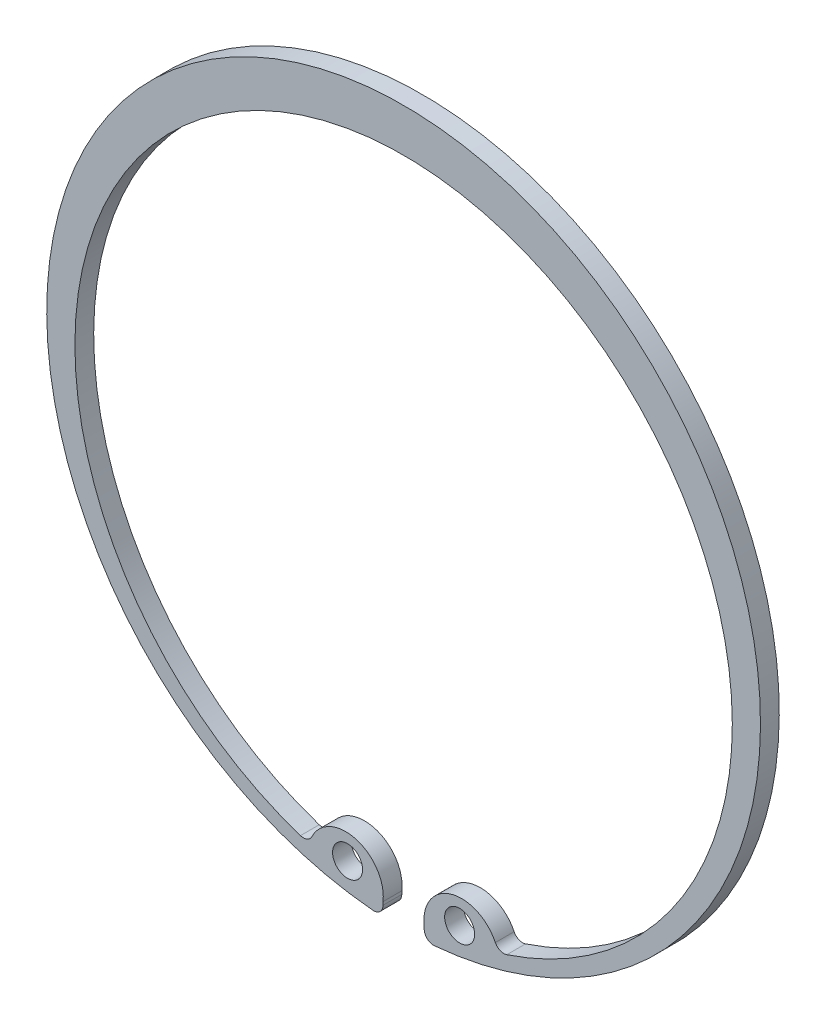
ISO-10303-21;
HEADER;
FILE_DESCRIPTION(('STEP AP214'),'2;1');
FILE_NAME('part.step','',(''),(''),'','','');
FILE_SCHEMA(('AUTOMOTIVE_DESIGN { 1 0 10303 214 1 1 1 1 }'));
ENDSEC;
DATA;
#1=APPLICATION_CONTEXT('core data for automotive mechanical design processes');
#2=APPLICATION_PROTOCOL_DEFINITION('international standard','automotive_design',2000,#1);
#3=PRODUCT_CONTEXT('',#1,'mechanical');
#4=PRODUCT('Part','Part','',(#3));
#5=PRODUCT_RELATED_PRODUCT_CATEGORY('part','',(#4));
#6=PRODUCT_DEFINITION_FORMATION('','',#4);
#7=PRODUCT_DEFINITION_CONTEXT('part definition',#1,'design');
#8=PRODUCT_DEFINITION('design','',#6,#7);
#9=PRODUCT_DEFINITION_SHAPE('','',#8);
#10=(LENGTH_UNIT() NAMED_UNIT(*) SI_UNIT(.MILLI.,.METRE.));
#11=(NAMED_UNIT(*) PLANE_ANGLE_UNIT() SI_UNIT($,.RADIAN.));
#12=(NAMED_UNIT(*) SI_UNIT($,.STERADIAN.) SOLID_ANGLE_UNIT());
#13=UNCERTAINTY_MEASURE_WITH_UNIT(LENGTH_MEASURE(1.E-05),#10,'distance_accuracy_value','');
#14=(GEOMETRIC_REPRESENTATION_CONTEXT(3) GLOBAL_UNCERTAINTY_ASSIGNED_CONTEXT((#13)) GLOBAL_UNIT_ASSIGNED_CONTEXT((#10,
#11,#12)) REPRESENTATION_CONTEXT('',''));
#15=CARTESIAN_POINT('',(0.,0.,0.));
#16=DIRECTION('',(0.,0.,1.));
#17=DIRECTION('',(1.,0.,0.));
#18=AXIS2_PLACEMENT_3D('',#15,#16,#17);
#19=CARTESIAN_POINT('',(0.,0.,1.));
#20=DIRECTION('',(0.,0.,1.));
#21=DIRECTION('',(1.,0.,0.));
#22=AXIS2_PLACEMENT_3D('',#19,#20,#21);
#23=PLANE('',#22);
#24=CARTESIAN_POINT('',(0.,0.,1.));
#25=DIRECTION('',(0.,0.,1.));
#26=DIRECTION('',(1.,0.,0.));
#27=AXIS2_PLACEMENT_3D('',#24,#25,#26);
#28=CIRCLE('',#27,19.);
#29=CARTESIAN_POINT('',(1.64011368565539,-18.9290788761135,1.));
#30=VERTEX_POINT('',#29);
#31=CARTESIAN_POINT('',(-1.64011368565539,-18.9290788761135,1.));
#32=VERTEX_POINT('',#31);
#33=EDGE_CURVE('E141',#30,#32,#28,.T.);
#34=ORIENTED_EDGE('',*,*,#33,.T.);
#35=CARTESIAN_POINT('',(-1.59695279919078,-18.4309452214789,1.));
#36=DIRECTION('',(0.,0.,1.));
#37=DIRECTION('',(1.,0.,0.));
#38=AXIS2_PLACEMENT_3D('',#35,#36,#37);
#39=CIRCLE('',#38,0.5);
#40=CARTESIAN_POINT('',(-1.09695279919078,-18.4309452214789,1.));
#41=VERTEX_POINT('',#40);
#42=EDGE_CURVE('E167',#32,#41,#39,.T.);
#43=ORIENTED_EDGE('',*,*,#42,.T.);
#44=DIRECTION('',(0.,1.,0.));
#45=VECTOR('',#44,1.);
#46=CARTESIAN_POINT('',(-1.09695279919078,-18.9683076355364,1.));
#47=LINE('',#46,#45);
#48=CARTESIAN_POINT('',(-1.09695279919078,-18.2655860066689,1.));
#49=VERTEX_POINT('',#48);
#50=EDGE_CURVE('E144',#41,#49,#47,.T.);
#51=ORIENTED_EDGE('',*,*,#50,.T.);
#52=CARTESIAN_POINT('',(-3.08259444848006,-18.0263638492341,1.));
#53=DIRECTION('',(0.,0.,1.));
#54=DIRECTION('',(1.,0.,0.));
#55=AXIS2_PLACEMENT_3D('',#52,#53,#54);
#56=CIRCLE('',#55,2.);
#57=CARTESIAN_POINT('',(-4.88437347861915,-17.1582668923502,1.));
#58=VERTEX_POINT('',#57);
#59=EDGE_CURVE('E125',#49,#58,#56,.T.);
#60=ORIENTED_EDGE('',*,*,#59,.T.);
#61=CARTESIAN_POINT('',(-5.33481823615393,-16.9412426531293,1.));
#62=DIRECTION('',(0.,0.,1.));
#63=DIRECTION('',(1.,0.,0.));
#64=AXIS2_PLACEMENT_3D('',#61,#62,#63);
#65=CIRCLE('',#64,0.5);
#66=CARTESIAN_POINT('',(-5.49172465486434,-17.4159850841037,1.));
#67=VERTEX_POINT('',#66);
#68=EDGE_CURVE('E11',#58,#67,#65,.F.);
#69=ORIENTED_EDGE('',*,*,#68,.T.);
#70=CARTESIAN_POINT('',(0.,-0.8,1.));
#71=DIRECTION('',(0.,0.,-1.));
#72=DIRECTION('',(1.,0.,0.));
#73=AXIS2_PLACEMENT_3D('',#70,#71,#72);
#74=CIRCLE('',#73,17.5);
#75=CARTESIAN_POINT('',(5.49172465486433,-17.4159850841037,1.));
#76=VERTEX_POINT('',#75);
#77=EDGE_CURVE('E147',#67,#76,#74,.T.);
#78=ORIENTED_EDGE('',*,*,#77,.T.);
#79=CARTESIAN_POINT('',(5.33481823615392,-16.9412426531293,1.));
#80=DIRECTION('',(0.,0.,1.));
#81=DIRECTION('',(1.,0.,0.));
#82=AXIS2_PLACEMENT_3D('',#79,#80,#81);
#83=CIRCLE('',#82,0.5);
#84=CARTESIAN_POINT('',(4.88437347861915,-17.1582668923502,1.));
#85=VERTEX_POINT('',#84);
#86=EDGE_CURVE('E50',#76,#85,#83,.F.);
#87=ORIENTED_EDGE('',*,*,#86,.T.);
#88=CARTESIAN_POINT('',(3.08259444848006,-18.0263638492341,1.));
#89=DIRECTION('',(0.,0.,1.));
#90=DIRECTION('',(-1.,0.,0.));
#91=AXIS2_PLACEMENT_3D('',#88,#89,#90);
#92=CIRCLE('',#91,2.);
#93=CARTESIAN_POINT('',(1.09695279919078,-18.2655860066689,1.));
#94=VERTEX_POINT('',#93);
#95=EDGE_CURVE('E149',#85,#94,#92,.T.);
#96=ORIENTED_EDGE('',*,*,#95,.T.);
#97=DIRECTION('',(0.,-1.,0.));
#98=VECTOR('',#97,1.);
#99=CARTESIAN_POINT('',(1.09695279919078,-18.9683076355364,1.));
#100=LINE('',#99,#98);
#101=CARTESIAN_POINT('',(1.09695279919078,-18.4309452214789,1.));
#102=VERTEX_POINT('',#101);
#103=EDGE_CURVE('E151',#94,#102,#100,.T.);
#104=ORIENTED_EDGE('',*,*,#103,.T.);
#105=CARTESIAN_POINT('',(1.59695279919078,-18.4309452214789,1.));
#106=DIRECTION('',(0.,0.,1.));
#107=DIRECTION('',(1.,0.,0.));
#108=AXIS2_PLACEMENT_3D('',#105,#106,#107);
#109=CIRCLE('',#108,0.5);
#110=EDGE_CURVE('E165',#102,#30,#109,.T.);
#111=ORIENTED_EDGE('',*,*,#110,.T.);
#112=EDGE_LOOP('',(#34,#43,#51,#60,#69,#78,#87,#96,#104,#111));
#113=FACE_BOUND('',#112,.T.);
#114=CARTESIAN_POINT('',(-2.98328309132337,-17.3321267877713,1.));
#115=DIRECTION('',(0.,0.,1.));
#116=DIRECTION('',(1.,0.,0.));
#117=AXIS2_PLACEMENT_3D('',#114,#115,#116);
#118=CIRCLE('',#117,0.798800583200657);
#119=CARTESIAN_POINT('',(-2.18448250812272,-17.3321267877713,1.));
#120=VERTEX_POINT('',#119);
#121=EDGE_CURVE('E207',#120,#120,#118,.T.);
#122=ORIENTED_EDGE('',*,*,#121,.F.);
#123=EDGE_LOOP('',(#122));
#124=FACE_BOUND('',#123,.T.);
#125=CARTESIAN_POINT('',(2.98328309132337,-17.3321267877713,1.));
#126=DIRECTION('',(0.,0.,-1.));
#127=DIRECTION('',(-1.,0.,0.));
#128=AXIS2_PLACEMENT_3D('',#125,#126,#127);
#129=CIRCLE('',#128,0.798800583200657);
#130=CARTESIAN_POINT('',(2.18448250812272,-17.3321267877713,1.));
#131=VERTEX_POINT('',#130);
#132=EDGE_CURVE('E215',#131,#131,#129,.T.);
#133=ORIENTED_EDGE('',*,*,#132,.T.);
#134=EDGE_LOOP('',(#133));
#135=FACE_BOUND('',#134,.T.);
#136=ADVANCED_FACE('F27',(#113,#124,#135),#23,.T.);
#137=CARTESIAN_POINT('',(0.,0.,0.));
#138=DIRECTION('',(0.,0.,1.));
#139=DIRECTION('',(1.,0.,0.));
#140=AXIS2_PLACEMENT_3D('',#137,#138,#139);
#141=PLANE('',#140);
#142=DIRECTION('',(0.,1.,0.));
#143=VECTOR('',#142,1.);
#144=CARTESIAN_POINT('',(-1.09695279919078,-18.9683076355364,0.));
#145=LINE('',#144,#143);
#146=CARTESIAN_POINT('',(-1.09695279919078,-18.4309452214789,0.));
#147=VERTEX_POINT('',#146);
#148=CARTESIAN_POINT('',(-1.09695279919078,-18.2655860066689,0.));
#149=VERTEX_POINT('',#148);
#150=EDGE_CURVE('E107',#147,#149,#145,.T.);
#151=ORIENTED_EDGE('',*,*,#150,.F.);
#152=CARTESIAN_POINT('',(-1.59695279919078,-18.4309452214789,0.));
#153=DIRECTION('',(0.,0.,1.));
#154=DIRECTION('',(1.,0.,0.));
#155=AXIS2_PLACEMENT_3D('',#152,#153,#154);
#156=CIRCLE('',#155,0.5);
#157=CARTESIAN_POINT('',(-1.64011368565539,-18.9290788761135,0.));
#158=VERTEX_POINT('',#157);
#159=EDGE_CURVE('E158',#147,#158,#156,.F.);
#160=ORIENTED_EDGE('',*,*,#159,.T.);
#161=CARTESIAN_POINT('',(0.,0.,0.));
#162=DIRECTION('',(0.,0.,1.));
#163=DIRECTION('',(1.,0.,0.));
#164=AXIS2_PLACEMENT_3D('',#161,#162,#163);
#165=CIRCLE('',#164,19.);
#166=CARTESIAN_POINT('',(1.64011368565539,-18.9290788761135,0.));
#167=VERTEX_POINT('',#166);
#168=EDGE_CURVE('E118',#167,#158,#165,.T.);
#169=ORIENTED_EDGE('',*,*,#168,.F.);
#170=CARTESIAN_POINT('',(1.59695279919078,-18.4309452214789,0.));
#171=DIRECTION('',(0.,0.,1.));
#172=DIRECTION('',(1.,0.,0.));
#173=AXIS2_PLACEMENT_3D('',#170,#171,#172);
#174=CIRCLE('',#173,0.5);
#175=CARTESIAN_POINT('',(1.09695279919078,-18.4309452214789,0.));
#176=VERTEX_POINT('',#175);
#177=EDGE_CURVE('E156',#167,#176,#174,.F.);
#178=ORIENTED_EDGE('',*,*,#177,.T.);
#179=DIRECTION('',(0.,-1.,0.));
#180=VECTOR('',#179,1.);
#181=CARTESIAN_POINT('',(1.09695279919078,-18.9683076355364,0.));
#182=LINE('',#181,#180);
#183=CARTESIAN_POINT('',(1.09695279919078,-18.2655860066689,0.));
#184=VERTEX_POINT('',#183);
#185=EDGE_CURVE('E139',#184,#176,#182,.T.);
#186=ORIENTED_EDGE('',*,*,#185,.F.);
#187=CARTESIAN_POINT('',(3.08259444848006,-18.0263638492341,0.));
#188=DIRECTION('',(0.,0.,1.));
#189=DIRECTION('',(-1.,0.,0.));
#190=AXIS2_PLACEMENT_3D('',#187,#188,#189);
#191=CIRCLE('',#190,2.);
#192=CARTESIAN_POINT('',(4.88437347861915,-17.1582668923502,0.));
#193=VERTEX_POINT('',#192);
#194=EDGE_CURVE('E134',#193,#184,#191,.T.);
#195=ORIENTED_EDGE('',*,*,#194,.F.);
#196=CARTESIAN_POINT('',(5.33481823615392,-16.9412426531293,0.));
#197=DIRECTION('',(0.,0.,1.));
#198=DIRECTION('',(1.,0.,0.));
#199=AXIS2_PLACEMENT_3D('',#196,#197,#198);
#200=CIRCLE('',#199,0.5);
#201=CARTESIAN_POINT('',(5.49172465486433,-17.4159850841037,0.));
#202=VERTEX_POINT('',#201);
#203=EDGE_CURVE('E180',#193,#202,#200,.T.);
#204=ORIENTED_EDGE('',*,*,#203,.T.);
#205=CARTESIAN_POINT('',(0.,-0.8,0.));
#206=DIRECTION('',(0.,0.,-1.));
#207=DIRECTION('',(1.,0.,0.));
#208=AXIS2_PLACEMENT_3D('',#205,#206,#207);
#209=CIRCLE('',#208,17.5);
#210=CARTESIAN_POINT('',(-5.49172465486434,-17.4159850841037,0.));
#211=VERTEX_POINT('',#210);
#212=EDGE_CURVE('E131',#211,#202,#209,.T.);
#213=ORIENTED_EDGE('',*,*,#212,.F.);
#214=CARTESIAN_POINT('',(-5.33481823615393,-16.9412426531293,0.));
#215=DIRECTION('',(0.,0.,1.));
#216=DIRECTION('',(1.,0.,0.));
#217=AXIS2_PLACEMENT_3D('',#214,#215,#216);
#218=CIRCLE('',#217,0.5);
#219=CARTESIAN_POINT('',(-4.88437347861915,-17.1582668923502,0.));
#220=VERTEX_POINT('',#219);
#221=EDGE_CURVE('E35',#211,#220,#218,.T.);
#222=ORIENTED_EDGE('',*,*,#221,.T.);
#223=CARTESIAN_POINT('',(-3.08259444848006,-18.0263638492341,0.));
#224=DIRECTION('',(0.,0.,1.));
#225=DIRECTION('',(1.,0.,0.));
#226=AXIS2_PLACEMENT_3D('',#223,#224,#225);
#227=CIRCLE('',#226,2.);
#228=EDGE_CURVE('E117',#149,#220,#227,.T.);
#229=ORIENTED_EDGE('',*,*,#228,.F.);
#230=EDGE_LOOP('',(#151,#160,#169,#178,#186,#195,#204,#213,#222,#229));
#231=FACE_BOUND('',#230,.T.);
#232=CARTESIAN_POINT('',(-2.98328309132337,-17.3321267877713,0.));
#233=DIRECTION('',(0.,0.,1.));
#234=DIRECTION('',(1.,0.,0.));
#235=AXIS2_PLACEMENT_3D('',#232,#233,#234);
#236=CIRCLE('',#235,0.798800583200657);
#237=CARTESIAN_POINT('',(-2.18448250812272,-17.3321267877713,0.));
#238=VERTEX_POINT('',#237);
#239=EDGE_CURVE('E205',#238,#238,#236,.T.);
#240=ORIENTED_EDGE('',*,*,#239,.T.);
#241=EDGE_LOOP('',(#240));
#242=FACE_BOUND('',#241,.T.);
#243=CARTESIAN_POINT('',(2.98328309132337,-17.3321267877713,0.));
#244=DIRECTION('',(0.,0.,-1.));
#245=DIRECTION('',(-1.,0.,0.));
#246=AXIS2_PLACEMENT_3D('',#243,#244,#245);
#247=CIRCLE('',#246,0.798800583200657);
#248=CARTESIAN_POINT('',(2.18448250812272,-17.3321267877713,0.));
#249=VERTEX_POINT('',#248);
#250=EDGE_CURVE('E212',#249,#249,#247,.T.);
#251=ORIENTED_EDGE('',*,*,#250,.F.);
#252=EDGE_LOOP('',(#251));
#253=FACE_BOUND('',#252,.T.);
#254=ADVANCED_FACE('F128',(#231,#242,#253),#141,.F.);
#255=CARTESIAN_POINT('',(0.,0.,1.));
#256=DIRECTION('',(0.,0.,-1.));
#257=DIRECTION('',(-1.,0.,0.));
#258=AXIS2_PLACEMENT_3D('',#255,#256,#257);
#259=CYLINDRICAL_SURFACE('',#258,19.);
#260=ORIENTED_EDGE('',*,*,#168,.T.);
#261=DIRECTION('',(0.,0.,-1.));
#262=VECTOR('',#261,1.);
#263=CARTESIAN_POINT('',(-1.64011368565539,-18.9290788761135,1.));
#264=LINE('',#263,#262);
#265=EDGE_CURVE('E163',#158,#32,#264,.F.);
#266=ORIENTED_EDGE('',*,*,#265,.T.);
#267=ORIENTED_EDGE('',*,*,#33,.F.);
#268=DIRECTION('',(0.,0.,-1.));
#269=VECTOR('',#268,1.);
#270=CARTESIAN_POINT('',(1.64011368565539,-18.9290788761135,1.));
#271=LINE('',#270,#269);
#272=EDGE_CURVE('E160',#30,#167,#271,.T.);
#273=ORIENTED_EDGE('',*,*,#272,.T.);
#274=EDGE_LOOP('',(#260,#266,#267,#273));
#275=FACE_BOUND('',#274,.T.);
#276=ADVANCED_FACE('F29',(#275),#259,.T.);
#277=CARTESIAN_POINT('',(-1.09695279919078,-18.9683076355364,1.));
#278=DIRECTION('',(-1.,0.,0.));
#279=DIRECTION('',(0.,0.,1.));
#280=AXIS2_PLACEMENT_3D('',#277,#278,#279);
#281=PLANE('',#280);
#282=ORIENTED_EDGE('',*,*,#50,.F.);
#283=DIRECTION('',(0.,0.,-1.));
#284=VECTOR('',#283,1.);
#285=CARTESIAN_POINT('',(-1.09695279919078,-18.4309452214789,1.));
#286=LINE('',#285,#284);
#287=EDGE_CURVE('E114',#41,#147,#286,.T.);
#288=ORIENTED_EDGE('',*,*,#287,.T.);
#289=ORIENTED_EDGE('',*,*,#150,.T.);
#290=DIRECTION('',(0.,0.,-1.));
#291=VECTOR('',#290,1.);
#292=CARTESIAN_POINT('',(-1.09695279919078,-18.2655860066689,1.));
#293=LINE('',#292,#291);
#294=EDGE_CURVE('E111',#49,#149,#293,.T.);
#295=ORIENTED_EDGE('',*,*,#294,.F.);
#296=EDGE_LOOP('',(#282,#288,#289,#295));
#297=FACE_BOUND('',#296,.T.);
#298=ADVANCED_FACE('F110',(#297),#281,.F.);
#299=CARTESIAN_POINT('',(-3.08259444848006,-18.0263638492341,1.));
#300=DIRECTION('',(0.,0.,-1.));
#301=DIRECTION('',(-1.,0.,0.));
#302=AXIS2_PLACEMENT_3D('',#299,#300,#301);
#303=CYLINDRICAL_SURFACE('',#302,2.);
#304=ORIENTED_EDGE('',*,*,#228,.T.);
#305=DIRECTION('',(0.,0.,-1.));
#306=VECTOR('',#305,1.);
#307=CARTESIAN_POINT('',(-4.88437347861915,-17.1582668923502,1.));
#308=LINE('',#307,#306);
#309=EDGE_CURVE('E178',#220,#58,#308,.F.);
#310=ORIENTED_EDGE('',*,*,#309,.T.);
#311=ORIENTED_EDGE('',*,*,#59,.F.);
#312=ORIENTED_EDGE('',*,*,#294,.T.);
#313=EDGE_LOOP('',(#304,#310,#311,#312));
#314=FACE_BOUND('',#313,.T.);
#315=ADVANCED_FACE('F122',(#314),#303,.T.);
#316=CARTESIAN_POINT('',(0.,-0.8,1.));
#317=DIRECTION('',(0.,0.,-1.));
#318=DIRECTION('',(-1.,0.,0.));
#319=AXIS2_PLACEMENT_3D('',#316,#317,#318);
#320=CYLINDRICAL_SURFACE('',#319,17.5);
#321=ORIENTED_EDGE('',*,*,#212,.T.);
#322=DIRECTION('',(0.,0.,-1.));
#323=VECTOR('',#322,1.);
#324=CARTESIAN_POINT('',(5.49172465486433,-17.4159850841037,1.));
#325=LINE('',#324,#323);
#326=EDGE_CURVE('E176',#202,#76,#325,.F.);
#327=ORIENTED_EDGE('',*,*,#326,.T.);
#328=ORIENTED_EDGE('',*,*,#77,.F.);
#329=DIRECTION('',(0.,0.,-1.));
#330=VECTOR('',#329,1.);
#331=CARTESIAN_POINT('',(-5.49172465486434,-17.4159850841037,1.));
#332=LINE('',#331,#330);
#333=EDGE_CURVE('E173',#67,#211,#332,.T.);
#334=ORIENTED_EDGE('',*,*,#333,.T.);
#335=EDGE_LOOP('',(#321,#327,#328,#334));
#336=FACE_BOUND('',#335,.T.);
#337=ADVANCED_FACE('F188',(#336),#320,.F.);
#338=CARTESIAN_POINT('',(3.08259444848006,-18.0263638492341,1.));
#339=DIRECTION('',(0.,0.,-1.));
#340=DIRECTION('',(-1.,0.,0.));
#341=AXIS2_PLACEMENT_3D('',#338,#339,#340);
#342=CYLINDRICAL_SURFACE('',#341,2.);
#343=ORIENTED_EDGE('',*,*,#95,.F.);
#344=DIRECTION('',(0.,0.,-1.));
#345=VECTOR('',#344,1.);
#346=CARTESIAN_POINT('',(4.88437347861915,-17.1582668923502,1.));
#347=LINE('',#346,#345);
#348=EDGE_CURVE('E170',#85,#193,#347,.T.);
#349=ORIENTED_EDGE('',*,*,#348,.T.);
#350=ORIENTED_EDGE('',*,*,#194,.T.);
#351=DIRECTION('',(0.,0.,-1.));
#352=VECTOR('',#351,1.);
#353=CARTESIAN_POINT('',(1.09695279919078,-18.2655860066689,1.));
#354=LINE('',#353,#352);
#355=EDGE_CURVE('E126',#94,#184,#354,.T.);
#356=ORIENTED_EDGE('',*,*,#355,.F.);
#357=EDGE_LOOP('',(#343,#349,#350,#356));
#358=FACE_BOUND('',#357,.T.);
#359=ADVANCED_FACE('F193',(#358),#342,.T.);
#360=CARTESIAN_POINT('',(1.09695279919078,-18.9683076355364,1.));
#361=DIRECTION('',(1.,0.,0.));
#362=DIRECTION('',(0.,0.,-1.));
#363=AXIS2_PLACEMENT_3D('',#360,#361,#362);
#364=PLANE('',#363);
#365=ORIENTED_EDGE('',*,*,#185,.T.);
#366=DIRECTION('',(0.,0.,-1.));
#367=VECTOR('',#366,1.);
#368=CARTESIAN_POINT('',(1.09695279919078,-18.4309452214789,1.));
#369=LINE('',#368,#367);
#370=EDGE_CURVE('E42',#176,#102,#369,.F.);
#371=ORIENTED_EDGE('',*,*,#370,.T.);
#372=ORIENTED_EDGE('',*,*,#103,.F.);
#373=ORIENTED_EDGE('',*,*,#355,.T.);
#374=EDGE_LOOP('',(#365,#371,#372,#373));
#375=FACE_BOUND('',#374,.T.);
#376=ADVANCED_FACE('F239',(#375),#364,.F.);
#377=CARTESIAN_POINT('',(-1.59695279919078,-18.4309452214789,1.));
#378=DIRECTION('',(0.,0.,-1.));
#379=DIRECTION('',(-1.,0.,0.));
#380=AXIS2_PLACEMENT_3D('',#377,#378,#379);
#381=CYLINDRICAL_SURFACE('',#380,0.5);
#382=ORIENTED_EDGE('',*,*,#42,.F.);
#383=ORIENTED_EDGE('',*,*,#265,.F.);
#384=ORIENTED_EDGE('',*,*,#159,.F.);
#385=ORIENTED_EDGE('',*,*,#287,.F.);
#386=EDGE_LOOP('',(#382,#383,#384,#385));
#387=FACE_BOUND('',#386,.T.);
#388=ADVANCED_FACE('F242',(#387),#381,.T.);
#389=CARTESIAN_POINT('',(1.59695279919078,-18.4309452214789,1.));
#390=DIRECTION('',(0.,0.,-1.));
#391=DIRECTION('',(-1.,0.,0.));
#392=AXIS2_PLACEMENT_3D('',#389,#390,#391);
#393=CYLINDRICAL_SURFACE('',#392,0.5);
#394=ORIENTED_EDGE('',*,*,#110,.F.);
#395=ORIENTED_EDGE('',*,*,#370,.F.);
#396=ORIENTED_EDGE('',*,*,#177,.F.);
#397=ORIENTED_EDGE('',*,*,#272,.F.);
#398=EDGE_LOOP('',(#394,#395,#396,#397));
#399=FACE_BOUND('',#398,.T.);
#400=ADVANCED_FACE('F200',(#399),#393,.T.);
#401=CARTESIAN_POINT('',(5.33481823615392,-16.9412426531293,1.));
#402=DIRECTION('',(0.,0.,-1.));
#403=DIRECTION('',(-1.,0.,0.));
#404=AXIS2_PLACEMENT_3D('',#401,#402,#403);
#405=CYLINDRICAL_SURFACE('',#404,0.5);
#406=ORIENTED_EDGE('',*,*,#86,.F.);
#407=ORIENTED_EDGE('',*,*,#326,.F.);
#408=ORIENTED_EDGE('',*,*,#203,.F.);
#409=ORIENTED_EDGE('',*,*,#348,.F.);
#410=EDGE_LOOP('',(#406,#407,#408,#409));
#411=FACE_BOUND('',#410,.T.);
#412=ADVANCED_FACE('F191',(#411),#405,.F.);
#413=CARTESIAN_POINT('',(-5.33481823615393,-16.9412426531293,1.));
#414=DIRECTION('',(0.,0.,-1.));
#415=DIRECTION('',(-1.,0.,0.));
#416=AXIS2_PLACEMENT_3D('',#413,#414,#415);
#417=CYLINDRICAL_SURFACE('',#416,0.5);
#418=ORIENTED_EDGE('',*,*,#68,.F.);
#419=ORIENTED_EDGE('',*,*,#309,.F.);
#420=ORIENTED_EDGE('',*,*,#221,.F.);
#421=ORIENTED_EDGE('',*,*,#333,.F.);
#422=EDGE_LOOP('',(#418,#419,#420,#421));
#423=FACE_BOUND('',#422,.T.);
#424=ADVANCED_FACE('F229',(#423),#417,.F.);
#425=CARTESIAN_POINT('',(-2.98328309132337,-17.3321267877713,0.));
#426=DIRECTION('',(0.,0.,1.));
#427=DIRECTION('',(1.,0.,0.));
#428=AXIS2_PLACEMENT_3D('',#425,#426,#427);
#429=CYLINDRICAL_SURFACE('',#428,0.798800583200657);
#430=ORIENTED_EDGE('',*,*,#239,.F.);
#431=EDGE_LOOP('',(#430));
#432=FACE_BOUND('',#431,.T.);
#433=ORIENTED_EDGE('',*,*,#121,.T.);
#434=EDGE_LOOP('',(#433));
#435=FACE_BOUND('',#434,.T.);
#436=ADVANCED_FACE('F222',(#432,#435),#429,.F.);
#437=CARTESIAN_POINT('',(2.98328309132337,-17.3321267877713,0.));
#438=DIRECTION('',(0.,0.,1.));
#439=DIRECTION('',(1.,0.,0.));
#440=AXIS2_PLACEMENT_3D('',#437,#438,#439);
#441=CYLINDRICAL_SURFACE('',#440,0.798800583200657);
#442=ORIENTED_EDGE('',*,*,#250,.T.);
#443=EDGE_LOOP('',(#442));
#444=FACE_BOUND('',#443,.T.);
#445=ORIENTED_EDGE('',*,*,#132,.F.);
#446=EDGE_LOOP('',(#445));
#447=FACE_BOUND('',#446,.T.);
#448=ADVANCED_FACE('F220',(#444,#447),#441,.F.);
#449=CLOSED_SHELL('',(#136,#254,#276,#298,#315,#337,#359,#376,#388,#400,#412,#424,#436,#448));
#450=MANIFOLD_SOLID_BREP('B2',#449);
#451=ADVANCED_BREP_SHAPE_REPRESENTATION('',(#18,#450),#14);
#452=SHAPE_DEFINITION_REPRESENTATION(#9,#451);
ENDSEC;
END-ISO-10303-21;
